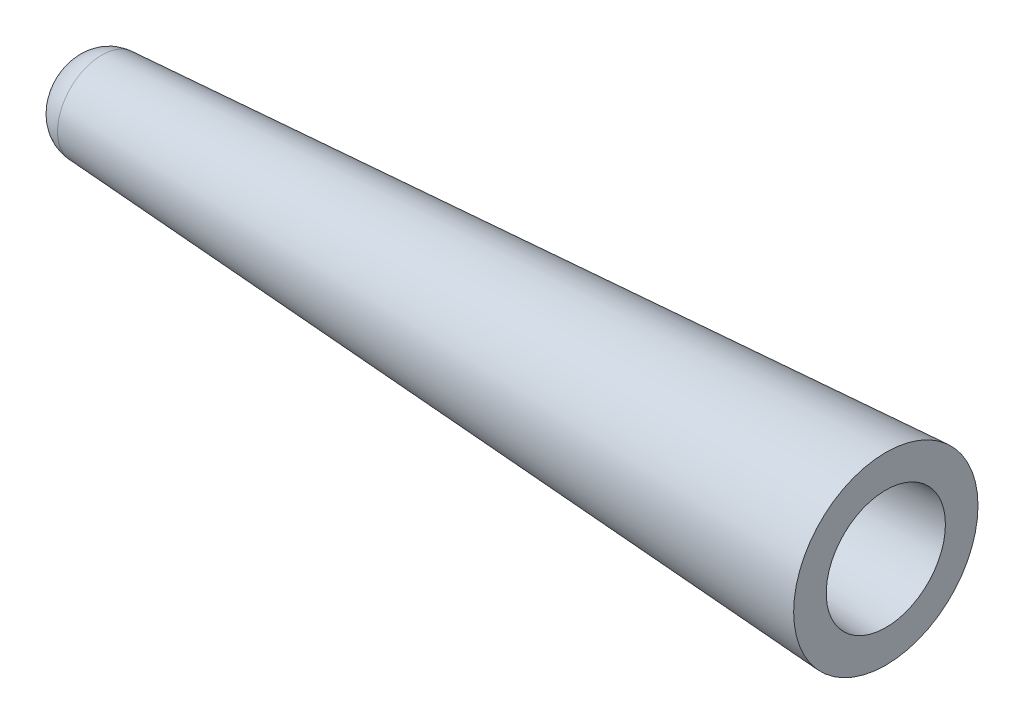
from build123d import *


with BuildPart() as part:
    # Sketch2 → Revolve2 (revolve)
    with BuildSketch(Plane.XY, mode=Mode.PRIVATE) as revolve2_sk:
        with BuildLine():
            Line((0, 0.6), (50, 3.658131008))
            Line((50, 3.658131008), (50, 5.658131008))
            Line((50, 5.658131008), (1.870676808, 2.714415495))
            ThreePointArc((1.870676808, 2.714415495), (0.497428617, 2.0446376), (0, 0.6))
        make_face()
    revolve(revolve2_sk.sketch.rotate(Axis((-19.275847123, 0, 0), (1, 0, 0)), 90), axis=Axis((-19.275847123, 0, 0), (1, 0, 0)))

    # Sketch4 → Revolve3 (revolve)
    with BuildSketch(Plane.XY, mode=Mode.PRIVATE) as revolve3_sk:
        with BuildLine():
            Line((112.60990337, 5.658131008), (120, 5.658131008))
            Line((120, 5.658131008), (120, 3.658131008))
            Line((120, 3.658131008), (112.60990337, 3.658131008))
            ThreePointArc((112.60990337, 3.658131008), (110.373835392, 2.658131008), (108.137767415, 3.658131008))
            ThreePointArc((108.137767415, 3.658131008), (105.901699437, 2.658131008), (103.66563146, 3.658131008))
            ThreePointArc((103.66563146, 3.658131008), (101.429563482, 2.658131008), (99.193495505, 3.658131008))
            ThreePointArc((99.193495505, 3.658131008), (96.957427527, 2.658131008), (94.72135955, 3.658131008))
            ThreePointArc((94.72135955, 3.658131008), (92.485291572, 2.658131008), (90.249223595, 3.658131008))
            ThreePointArc((90.249223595, 3.658131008), (88.013155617, 2.658131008), (85.77708764, 3.658131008))
            ThreePointArc((85.77708764, 3.658131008), (83.541019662, 2.658131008), (81.304951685, 3.658131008))
            ThreePointArc((81.304951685, 3.658131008), (79.068883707, 2.658131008), (76.83281573, 3.658131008))
            ThreePointArc((76.83281573, 3.658131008), (74.596747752, 2.658131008), (72.360679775, 3.658131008))
            ThreePointArc((72.360679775, 3.658131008), (70.124611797, 2.658131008), (67.88854382, 3.658131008))
            ThreePointArc((67.88854382, 3.658131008), (65.652475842, 2.658131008), (63.416407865, 3.658131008))
            ThreePointArc((63.416407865, 3.658131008), (61.180339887, 2.658131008), (58.94427191, 3.658131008))
            ThreePointArc((58.94427191, 3.658131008), (56.708203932, 2.658131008), (54.472135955, 3.658131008))
            ThreePointArc((54.472135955, 3.658131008), (52.236067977, 2.658131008), (50, 3.658131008))
            Line((50, 3.658131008), (50, 5.658131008))
            ThreePointArc((50, 5.658131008), (52.236067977, 6.658131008), (54.472135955, 5.658131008))
            ThreePointArc((54.472135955, 5.658131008), (56.708203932, 6.658131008), (58.94427191, 5.658131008))
            ThreePointArc((58.94427191, 5.658131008), (61.180339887, 6.658131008), (63.416407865, 5.658131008))
            ThreePointArc((63.416407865, 5.658131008), (65.652475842, 6.658131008), (67.88854382, 5.658131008))
            ThreePointArc((67.88854382, 5.658131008), (70.124611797, 6.658131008), (72.360679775, 5.658131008))
            ThreePointArc((72.360679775, 5.658131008), (74.596747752, 6.658131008), (76.83281573, 5.658131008))
            ThreePointArc((76.83281573, 5.658131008), (79.068883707, 6.658131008), (81.304951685, 5.658131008))
            ThreePointArc((81.304951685, 5.658131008), (83.541019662, 6.658131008), (85.77708764, 5.658131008))
            ThreePointArc((85.77708764, 5.658131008), (88.013155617, 6.658131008), (90.249223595, 5.658131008))
            ThreePointArc((90.249223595, 5.658131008), (92.485291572, 6.658131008), (94.72135955, 5.658131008))
            ThreePointArc((94.72135955, 5.658131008), (96.957427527, 6.658131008), (99.193495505, 5.658131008))
            ThreePointArc((99.193495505, 5.658131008), (101.429563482, 6.658131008), (103.66563146, 5.658131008))
            ThreePointArc((103.66563146, 5.658131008), (105.901699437, 6.658131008), (108.137767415, 5.658131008))
            ThreePointArc((108.137767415, 5.658131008), (110.373835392, 6.658131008), (112.60990337, 5.658131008))
        make_face()
    revolve(revolve3_sk.sketch.rotate(Axis((21.024758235, 0, 0), (1, 0, 0)), 90), axis=Axis((21.024758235, 0, 0), (1, 0, 0)))

    # Sketch5 → Revolve4 (revolve)
    with BuildSketch(Plane.XY, mode=Mode.PRIVATE) as revolve4_sk:
        Polygon((120, 3.658131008), (120, 5.658131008), (166.535898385, 5.658131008), (170, 3.658131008), align=None)
    revolve(revolve4_sk.sketch.rotate(Axis((115.901619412, 0, 0), (1, 0, 0)), 90), axis=Axis((115.901619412, 0, 0), (1, 0, 0)))

    # SurfaceCut1
    split(bisect_by=Plane(origin=(50, 0, 0), x_dir=(0, 0, -1), z_dir=(1, 0, 0)), keep=Keep.BOTTOM)


solid = part.part
